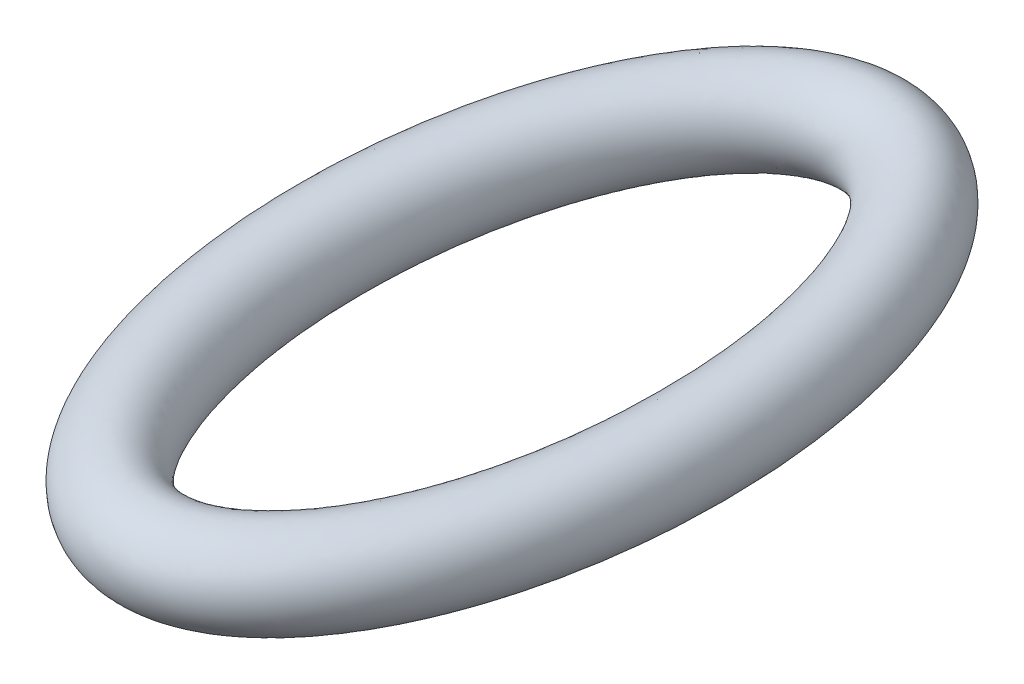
ISO-10303-21;
HEADER;
FILE_DESCRIPTION(('STEP AP214'),'2;1');
FILE_NAME('part.step','',(''),(''),'','','');
FILE_SCHEMA(('AUTOMOTIVE_DESIGN { 1 0 10303 214 1 1 1 1 }'));
ENDSEC;
DATA;
#1=APPLICATION_CONTEXT('core data for automotive mechanical design processes');
#2=APPLICATION_PROTOCOL_DEFINITION('international standard','automotive_design',2000,#1);
#3=PRODUCT_CONTEXT('',#1,'mechanical');
#4=PRODUCT('Part','Part','',(#3));
#5=PRODUCT_RELATED_PRODUCT_CATEGORY('part','',(#4));
#6=PRODUCT_DEFINITION_FORMATION('','',#4);
#7=PRODUCT_DEFINITION_CONTEXT('part definition',#1,'design');
#8=PRODUCT_DEFINITION('design','',#6,#7);
#9=PRODUCT_DEFINITION_SHAPE('','',#8);
#10=(LENGTH_UNIT() NAMED_UNIT(*) SI_UNIT(.MILLI.,.METRE.));
#11=(NAMED_UNIT(*) PLANE_ANGLE_UNIT() SI_UNIT($,.RADIAN.));
#12=(NAMED_UNIT(*) SI_UNIT($,.STERADIAN.) SOLID_ANGLE_UNIT());
#13=UNCERTAINTY_MEASURE_WITH_UNIT(LENGTH_MEASURE(1.E-05),#10,'distance_accuracy_value','');
#14=(GEOMETRIC_REPRESENTATION_CONTEXT(3) GLOBAL_UNCERTAINTY_ASSIGNED_CONTEXT((#13)) GLOBAL_UNIT_ASSIGNED_CONTEXT((#10,
#11,#12)) REPRESENTATION_CONTEXT('',''));
#15=CARTESIAN_POINT('',(0.,0.,0.));
#16=DIRECTION('',(0.,0.,1.));
#17=DIRECTION('',(1.,0.,0.));
#18=AXIS2_PLACEMENT_3D('',#15,#16,#17);
#19=CARTESIAN_POINT('',(50.,0.,0.));
#20=CARTESIAN_POINT('',(50.,0.,-6.01289865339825));
#21=CARTESIAN_POINT('',(49.3653925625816,0.,-17.6721832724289));
#22=CARTESIAN_POINT('',(46.8375894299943,0.,-33.5032940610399));
#23=CARTESIAN_POINT('',(43.1518349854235,0.,-47.1498640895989));
#24=CARTESIAN_POINT('',(38.7045890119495,0.,-58.47437408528));
#25=CARTESIAN_POINT('',(33.8151288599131,0.,-67.5938487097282));
#26=CARTESIAN_POINT('',(28.9431747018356,0.,-74.4244203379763));
#27=CARTESIAN_POINT('',(24.2594365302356,0.,-79.4884106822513));
#28=CARTESIAN_POINT('',(19.8460357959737,0.,-83.2015332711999));
#29=CARTESIAN_POINT('',(15.5042691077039,0.,-85.9789216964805));
#30=CARTESIAN_POINT('',(11.2896250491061,0.,-87.9420714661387));
#31=CARTESIAN_POINT('',(7.26191414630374,0.,-89.2035103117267));
#32=CARTESIAN_POINT('',(3.46411374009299,0.,-89.8739054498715));
#33=CARTESIAN_POINT('',(1.13057688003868,0.,-89.9999999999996));
#34=CARTESIAN_POINT('',(-1.13057688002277,0.,-90.0000000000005));
#35=CARTESIAN_POINT('',(-3.46411374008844,0.,-89.8739054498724));
#36=CARTESIAN_POINT('',(-7.26191414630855,0.,-89.2035103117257));
#37=CARTESIAN_POINT('',(-11.2896250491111,0.,-87.9420714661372));
#38=CARTESIAN_POINT('',(-15.504269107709,0.,-85.9789216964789));
#39=CARTESIAN_POINT('',(-19.8460357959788,0.,-83.201533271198));
#40=CARTESIAN_POINT('',(-24.2594365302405,0.,-79.4884106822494));
#41=CARTESIAN_POINT('',(-28.9431747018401,0.,-74.4244203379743));
#42=CARTESIAN_POINT('',(-33.815128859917,0.,-67.5938487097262));
#43=CARTESIAN_POINT('',(-38.7045890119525,0.,-58.4743740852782));
#44=CARTESIAN_POINT('',(-43.1518349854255,0.,-47.1498640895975));
#45=CARTESIAN_POINT('',(-46.8375894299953,0.,-33.5032940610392));
#46=CARTESIAN_POINT('',(-49.3653925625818,0.,-17.6721832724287));
#47=CARTESIAN_POINT('',(-50.,0.,-6.01289865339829));
#48=CARTESIAN_POINT('',(-50.,0.,6.01289865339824));
#49=CARTESIAN_POINT('',(-49.3653925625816,0.,17.6721832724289));
#50=CARTESIAN_POINT('',(-46.8375894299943,0.,33.50329406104));
#51=CARTESIAN_POINT('',(-43.1518349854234,0.,47.1498640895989));
#52=CARTESIAN_POINT('',(-38.7045890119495,0.,58.4743740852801));
#53=CARTESIAN_POINT('',(-33.815128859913,0.,67.5938487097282));
#54=CARTESIAN_POINT('',(-28.9431747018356,0.,74.4244203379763));
#55=CARTESIAN_POINT('',(-24.2594365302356,0.,79.4884106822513));
#56=CARTESIAN_POINT('',(-19.8460357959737,0.,83.2015332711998));
#57=CARTESIAN_POINT('',(-15.5042691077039,0.,85.9789216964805));
#58=CARTESIAN_POINT('',(-11.2896250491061,0.,87.9420714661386));
#59=CARTESIAN_POINT('',(-7.26191414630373,0.,89.2035103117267));
#60=CARTESIAN_POINT('',(-3.46411374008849,0.,89.8739054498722));
#61=CARTESIAN_POINT('',(-1.13057688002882,0.,90.0000000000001));
#62=CARTESIAN_POINT('',(1.13057688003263,0.,89.9999999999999));
#63=CARTESIAN_POINT('',(3.46411374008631,0.,89.8739054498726));
#64=CARTESIAN_POINT('',(7.26191414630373,0.,89.2035103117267));
#65=CARTESIAN_POINT('',(11.2896250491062,0.,87.9420714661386));
#66=CARTESIAN_POINT('',(15.5042691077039,0.,85.9789216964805));
#67=CARTESIAN_POINT('',(19.8460357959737,0.,83.2015332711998));
#68=CARTESIAN_POINT('',(24.2594365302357,0.,79.4884106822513));
#69=CARTESIAN_POINT('',(28.9431747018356,0.,74.4244203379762));
#70=CARTESIAN_POINT('',(33.8151288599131,0.,67.5938487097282));
#71=CARTESIAN_POINT('',(38.7045890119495,0.,58.47437408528));
#72=CARTESIAN_POINT('',(43.1518349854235,0.,47.1498640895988));
#73=CARTESIAN_POINT('',(46.8375894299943,0.,33.5032940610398));
#74=CARTESIAN_POINT('',(49.3653925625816,0.,17.6721832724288));
#75=CARTESIAN_POINT('',(50.,0.,6.01289865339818));
#76=CARTESIAN_POINT('',(50.,0.,0.));
#77=CARTESIAN_POINT('',(50.,20.,0.));
#78=CARTESIAN_POINT('',(50.,20.,-6.01289865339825));
#79=CARTESIAN_POINT('',(49.3653925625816,20.,-17.6721832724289));
#80=CARTESIAN_POINT('',(46.8375894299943,20.,-33.5032940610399));
#81=CARTESIAN_POINT('',(43.1518349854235,20.,-47.1498640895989));
#82=CARTESIAN_POINT('',(38.7045890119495,20.,-58.47437408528));
#83=CARTESIAN_POINT('',(33.8151288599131,20.,-67.5938487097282));
#84=CARTESIAN_POINT('',(28.9431747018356,20.,-74.4244203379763));
#85=CARTESIAN_POINT('',(24.2594365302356,20.,-79.4884106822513));
#86=CARTESIAN_POINT('',(19.8460357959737,20.,-83.2015332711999));
#87=CARTESIAN_POINT('',(15.5042691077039,20.,-85.9789216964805));
#88=CARTESIAN_POINT('',(11.2896250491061,20.,-87.9420714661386));
#89=CARTESIAN_POINT('',(7.26191414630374,20.,-89.2035103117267));
#90=CARTESIAN_POINT('',(3.464113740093,20.,-89.8739054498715));
#91=CARTESIAN_POINT('',(1.13057688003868,20.,-89.9999999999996));
#92=CARTESIAN_POINT('',(-1.13057688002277,20.,-90.0000000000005));
#93=CARTESIAN_POINT('',(-3.46411374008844,20.,-89.8739054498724));
#94=CARTESIAN_POINT('',(-7.26191414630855,20.,-89.2035103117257));
#95=CARTESIAN_POINT('',(-11.2896250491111,20.,-87.9420714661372));
#96=CARTESIAN_POINT('',(-15.504269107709,20.,-85.9789216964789));
#97=CARTESIAN_POINT('',(-19.8460357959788,20.,-83.201533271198));
#98=CARTESIAN_POINT('',(-24.2594365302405,20.,-79.4884106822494));
#99=CARTESIAN_POINT('',(-28.9431747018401,20.,-74.4244203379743));
#100=CARTESIAN_POINT('',(-33.815128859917,20.,-67.5938487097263));
#101=CARTESIAN_POINT('',(-38.7045890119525,20.,-58.4743740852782));
#102=CARTESIAN_POINT('',(-43.1518349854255,20.,-47.1498640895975));
#103=CARTESIAN_POINT('',(-46.8375894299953,20.,-33.5032940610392));
#104=CARTESIAN_POINT('',(-49.3653925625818,20.,-17.6721832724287));
#105=CARTESIAN_POINT('',(-50.,20.,-6.01289865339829));
#106=CARTESIAN_POINT('',(-50.,20.,6.01289865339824));
#107=CARTESIAN_POINT('',(-49.3653925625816,20.,17.6721832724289));
#108=CARTESIAN_POINT('',(-46.8375894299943,20.,33.50329406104));
#109=CARTESIAN_POINT('',(-43.1518349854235,20.,47.1498640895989));
#110=CARTESIAN_POINT('',(-38.7045890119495,20.,58.4743740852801));
#111=CARTESIAN_POINT('',(-33.815128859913,20.,67.5938487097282));
#112=CARTESIAN_POINT('',(-28.9431747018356,20.,74.4244203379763));
#113=CARTESIAN_POINT('',(-24.2594365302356,20.,79.4884106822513));
#114=CARTESIAN_POINT('',(-19.8460357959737,20.,83.2015332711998));
#115=CARTESIAN_POINT('',(-15.5042691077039,20.,85.9789216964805));
#116=CARTESIAN_POINT('',(-11.2896250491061,20.,87.9420714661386));
#117=CARTESIAN_POINT('',(-7.26191414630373,20.,89.2035103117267));
#118=CARTESIAN_POINT('',(-3.46411374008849,20.,89.8739054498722));
#119=CARTESIAN_POINT('',(-1.13057688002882,20.,90.0000000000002));
#120=CARTESIAN_POINT('',(1.13057688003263,20.,89.9999999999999));
#121=CARTESIAN_POINT('',(3.46411374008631,20.,89.8739054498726));
#122=CARTESIAN_POINT('',(7.26191414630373,20.,89.2035103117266));
#123=CARTESIAN_POINT('',(11.2896250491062,20.,87.9420714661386));
#124=CARTESIAN_POINT('',(15.5042691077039,20.,85.9789216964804));
#125=CARTESIAN_POINT('',(19.8460357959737,20.,83.2015332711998));
#126=CARTESIAN_POINT('',(24.2594365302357,20.,79.4884106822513));
#127=CARTESIAN_POINT('',(28.9431747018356,20.,74.4244203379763));
#128=CARTESIAN_POINT('',(33.8151288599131,20.,67.5938487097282));
#129=CARTESIAN_POINT('',(38.7045890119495,20.,58.47437408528));
#130=CARTESIAN_POINT('',(43.1518349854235,20.,47.1498640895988));
#131=CARTESIAN_POINT('',(46.8375894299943,20.,33.5032940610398));
#132=CARTESIAN_POINT('',(49.3653925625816,20.,17.6721832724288));
#133=CARTESIAN_POINT('',(50.,20.,6.01289865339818));
#134=CARTESIAN_POINT('',(50.,20.,0.));
#135=CARTESIAN_POINT('',(30.,20.,0.));
#136=CARTESIAN_POINT('',(30.,20.,-5.3141403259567));
#137=CARTESIAN_POINT('',(29.4395134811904,20.,-15.5759082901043));
#138=CARTESIAN_POINT('',(27.2336156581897,20.,-29.3632891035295));
#139=CARTESIAN_POINT('',(24.098703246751,20.,-40.9377840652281));
#140=CARTESIAN_POINT('',(20.4713989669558,20.,-50.1442313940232));
#141=CARTESIAN_POINT('',(16.7262725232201,20.,-57.0995138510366));
#142=CARTESIAN_POINT('',(13.3093268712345,20.,-61.8635213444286));
#143=CARTESIAN_POINT('',(10.3640922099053,20.,-65.0311658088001));
#144=CARTESIAN_POINT('',(7.90822260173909,20.,-67.0841707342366));
#145=CARTESIAN_POINT('',(5.7959192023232,20.,-68.425196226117));
#146=CARTESIAN_POINT('',(4.004408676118,20.,-69.2531426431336));
#147=CARTESIAN_POINT('',(2.47916126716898,20.,-69.7263179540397));
#148=CARTESIAN_POINT('',(1.16493567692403,20.,-69.9579759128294));
#149=CARTESIAN_POINT('',(0.364184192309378,20.,-70.0000000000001));
#150=CARTESIAN_POINT('',(-0.364184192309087,20.,-70.));
#151=CARTESIAN_POINT('',(-1.16493567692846,20.,-69.9579759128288));
#152=CARTESIAN_POINT('',(-2.47916126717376,20.,-69.7263179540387));
#153=CARTESIAN_POINT('',(-4.00440867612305,20.,-69.2531426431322));
#154=CARTESIAN_POINT('',(-5.79591920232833,20.,-68.4251962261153));
#155=CARTESIAN_POINT('',(-7.90822260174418,20.,-67.0841707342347));
#156=CARTESIAN_POINT('',(-10.3640922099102,20.,-65.0311658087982));
#157=CARTESIAN_POINT('',(-13.309326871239,20.,-61.8635213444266));
#158=CARTESIAN_POINT('',(-16.726272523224,20.,-57.0995138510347));
#159=CARTESIAN_POINT('',(-20.4713989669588,20.,-50.1442313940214));
#160=CARTESIAN_POINT('',(-24.098703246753,20.,-40.9377840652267));
#161=CARTESIAN_POINT('',(-27.2336156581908,20.,-29.3632891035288));
#162=CARTESIAN_POINT('',(-29.4395134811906,20.,-15.5759082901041));
#163=CARTESIAN_POINT('',(-30.,20.,-5.31414032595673));
#164=CARTESIAN_POINT('',(-30.,20.,5.31414032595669));
#165=CARTESIAN_POINT('',(-29.4395134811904,20.,15.5759082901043));
#166=CARTESIAN_POINT('',(-27.2336156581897,20.,29.3632891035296));
#167=CARTESIAN_POINT('',(-24.098703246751,20.,40.9377840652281));
#168=CARTESIAN_POINT('',(-20.4713989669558,20.,50.1442313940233));
#169=CARTESIAN_POINT('',(-16.72627252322,20.,57.0995138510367));
#170=CARTESIAN_POINT('',(-13.3093268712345,20.,61.8635213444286));
#171=CARTESIAN_POINT('',(-10.3640922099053,20.,65.0311658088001));
#172=CARTESIAN_POINT('',(-7.90822260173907,20.,67.0841707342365));
#173=CARTESIAN_POINT('',(-5.79591920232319,20.,68.425196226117));
#174=CARTESIAN_POINT('',(-4.00440867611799,20.,69.2531426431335));
#175=CARTESIAN_POINT('',(-2.47916126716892,20.,69.7263179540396));
#176=CARTESIAN_POINT('',(-1.16493567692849,20.,69.9579759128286));
#177=CARTESIAN_POINT('',(-0.364184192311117,20.,69.9999999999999));
#178=CARTESIAN_POINT('',(0.36418419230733,20.,70.0000000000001));
#179=CARTESIAN_POINT('',(1.1649356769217,20.,69.9579759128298));
#180=CARTESIAN_POINT('',(2.47916126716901,20.,69.7263179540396));
#181=CARTESIAN_POINT('',(4.004408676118,20.,69.2531426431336));
#182=CARTESIAN_POINT('',(5.79591920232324,20.,68.4251962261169));
#183=CARTESIAN_POINT('',(7.90822260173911,20.,67.0841707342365));
#184=CARTESIAN_POINT('',(10.3640922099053,20.,65.0311658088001));
#185=CARTESIAN_POINT('',(13.3093268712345,20.,61.8635213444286));
#186=CARTESIAN_POINT('',(16.7262725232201,20.,57.0995138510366));
#187=CARTESIAN_POINT('',(20.4713989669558,20.,50.1442313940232));
#188=CARTESIAN_POINT('',(24.098703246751,20.,40.937784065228));
#189=CARTESIAN_POINT('',(27.2336156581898,20.,29.3632891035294));
#190=CARTESIAN_POINT('',(29.4395134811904,20.,15.5759082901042));
#191=CARTESIAN_POINT('',(30.,20.,5.31414032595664));
#192=CARTESIAN_POINT('',(30.,20.,0.));
#193=CARTESIAN_POINT('',(30.,0.,0.));
#194=CARTESIAN_POINT('',(30.,0.,-5.3141403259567));
#195=CARTESIAN_POINT('',(29.4395134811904,0.,-15.5759082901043));
#196=CARTESIAN_POINT('',(27.2336156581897,0.,-29.3632891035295));
#197=CARTESIAN_POINT('',(24.098703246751,0.,-40.9377840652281));
#198=CARTESIAN_POINT('',(20.4713989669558,0.,-50.1442313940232));
#199=CARTESIAN_POINT('',(16.7262725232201,0.,-57.0995138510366));
#200=CARTESIAN_POINT('',(13.3093268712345,0.,-61.8635213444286));
#201=CARTESIAN_POINT('',(10.3640922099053,0.,-65.0311658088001));
#202=CARTESIAN_POINT('',(7.90822260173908,0.,-67.0841707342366));
#203=CARTESIAN_POINT('',(5.7959192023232,0.,-68.425196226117));
#204=CARTESIAN_POINT('',(4.004408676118,0.,-69.2531426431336));
#205=CARTESIAN_POINT('',(2.47916126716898,0.,-69.7263179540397));
#206=CARTESIAN_POINT('',(1.16493567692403,0.,-69.9579759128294));
#207=CARTESIAN_POINT('',(0.364184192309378,0.,-70.0000000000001));
#208=CARTESIAN_POINT('',(-0.364184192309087,0.,-70.));
#209=CARTESIAN_POINT('',(-1.16493567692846,0.,-69.9579759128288));
#210=CARTESIAN_POINT('',(-2.47916126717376,0.,-69.7263179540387));
#211=CARTESIAN_POINT('',(-4.00440867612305,0.,-69.2531426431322));
#212=CARTESIAN_POINT('',(-5.79591920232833,0.,-68.4251962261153));
#213=CARTESIAN_POINT('',(-7.90822260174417,0.,-67.0841707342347));
#214=CARTESIAN_POINT('',(-10.3640922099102,0.,-65.0311658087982));
#215=CARTESIAN_POINT('',(-13.309326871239,0.,-61.8635213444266));
#216=CARTESIAN_POINT('',(-16.726272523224,0.,-57.0995138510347));
#217=CARTESIAN_POINT('',(-20.4713989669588,0.,-50.1442313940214));
#218=CARTESIAN_POINT('',(-24.098703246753,0.,-40.9377840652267));
#219=CARTESIAN_POINT('',(-27.2336156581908,0.,-29.3632891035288));
#220=CARTESIAN_POINT('',(-29.4395134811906,0.,-15.5759082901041));
#221=CARTESIAN_POINT('',(-30.,0.,-5.31414032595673));
#222=CARTESIAN_POINT('',(-30.,0.,5.3141403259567));
#223=CARTESIAN_POINT('',(-29.4395134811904,0.,15.5759082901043));
#224=CARTESIAN_POINT('',(-27.2336156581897,0.,29.3632891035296));
#225=CARTESIAN_POINT('',(-24.098703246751,0.,40.9377840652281));
#226=CARTESIAN_POINT('',(-20.4713989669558,0.,50.1442313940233));
#227=CARTESIAN_POINT('',(-16.72627252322,0.,57.0995138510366));
#228=CARTESIAN_POINT('',(-13.3093268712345,0.,61.8635213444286));
#229=CARTESIAN_POINT('',(-10.3640922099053,0.,65.0311658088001));
#230=CARTESIAN_POINT('',(-7.90822260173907,0.,67.0841707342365));
#231=CARTESIAN_POINT('',(-5.79591920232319,0.,68.425196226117));
#232=CARTESIAN_POINT('',(-4.00440867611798,0.,69.2531426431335));
#233=CARTESIAN_POINT('',(-2.47916126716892,0.,69.7263179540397));
#234=CARTESIAN_POINT('',(-1.16493567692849,0.,69.9579759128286));
#235=CARTESIAN_POINT('',(-0.364184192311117,0.,69.9999999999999));
#236=CARTESIAN_POINT('',(0.36418419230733,0.,70.0000000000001));
#237=CARTESIAN_POINT('',(1.1649356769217,0.,69.9579759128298));
#238=CARTESIAN_POINT('',(2.47916126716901,0.,69.7263179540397));
#239=CARTESIAN_POINT('',(4.004408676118,0.,69.2531426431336));
#240=CARTESIAN_POINT('',(5.79591920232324,0.,68.4251962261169));
#241=CARTESIAN_POINT('',(7.90822260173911,0.,67.0841707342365));
#242=CARTESIAN_POINT('',(10.3640922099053,0.,65.0311658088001));
#243=CARTESIAN_POINT('',(13.3093268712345,0.,61.8635213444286));
#244=CARTESIAN_POINT('',(16.7262725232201,0.,57.0995138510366));
#245=CARTESIAN_POINT('',(20.4713989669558,0.,50.1442313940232));
#246=CARTESIAN_POINT('',(24.098703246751,0.,40.937784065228));
#247=CARTESIAN_POINT('',(27.2336156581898,0.,29.3632891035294));
#248=CARTESIAN_POINT('',(29.4395134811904,0.,15.5759082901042));
#249=CARTESIAN_POINT('',(30.,0.,5.31414032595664));
#250=CARTESIAN_POINT('',(30.,0.,0.));
#251=CARTESIAN_POINT('',(30.,-20.,0.));
#252=CARTESIAN_POINT('',(30.,-20.,-5.3141403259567));
#253=CARTESIAN_POINT('',(29.4395134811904,-20.,-15.5759082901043));
#254=CARTESIAN_POINT('',(27.2336156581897,-20.,-29.3632891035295));
#255=CARTESIAN_POINT('',(24.098703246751,-20.,-40.9377840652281));
#256=CARTESIAN_POINT('',(20.4713989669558,-20.,-50.1442313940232));
#257=CARTESIAN_POINT('',(16.7262725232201,-20.,-57.0995138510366));
#258=CARTESIAN_POINT('',(13.3093268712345,-20.,-61.8635213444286));
#259=CARTESIAN_POINT('',(10.3640922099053,-20.,-65.0311658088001));
#260=CARTESIAN_POINT('',(7.90822260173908,-20.,-67.0841707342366));
#261=CARTESIAN_POINT('',(5.7959192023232,-20.,-68.425196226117));
#262=CARTESIAN_POINT('',(4.004408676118,-20.,-69.2531426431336));
#263=CARTESIAN_POINT('',(2.47916126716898,-20.,-69.7263179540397));
#264=CARTESIAN_POINT('',(1.16493567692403,-20.,-69.9579759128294));
#265=CARTESIAN_POINT('',(0.364184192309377,-20.,-70.0000000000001));
#266=CARTESIAN_POINT('',(-0.364184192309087,-20.,-70.));
#267=CARTESIAN_POINT('',(-1.16493567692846,-20.,-69.9579759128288));
#268=CARTESIAN_POINT('',(-2.47916126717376,-20.,-69.7263179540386));
#269=CARTESIAN_POINT('',(-4.00440867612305,-20.,-69.2531426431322));
#270=CARTESIAN_POINT('',(-5.79591920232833,-20.,-68.4251962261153));
#271=CARTESIAN_POINT('',(-7.90822260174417,-20.,-67.0841707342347));
#272=CARTESIAN_POINT('',(-10.3640922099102,-20.,-65.0311658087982));
#273=CARTESIAN_POINT('',(-13.309326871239,-20.,-61.8635213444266));
#274=CARTESIAN_POINT('',(-16.726272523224,-20.,-57.0995138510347));
#275=CARTESIAN_POINT('',(-20.4713989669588,-20.,-50.1442313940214));
#276=CARTESIAN_POINT('',(-24.098703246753,-20.,-40.9377840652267));
#277=CARTESIAN_POINT('',(-27.2336156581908,-20.,-29.3632891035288));
#278=CARTESIAN_POINT('',(-29.4395134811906,-20.,-15.5759082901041));
#279=CARTESIAN_POINT('',(-30.,-20.,-5.31414032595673));
#280=CARTESIAN_POINT('',(-30.,-20.,5.31414032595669));
#281=CARTESIAN_POINT('',(-29.4395134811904,-20.,15.5759082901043));
#282=CARTESIAN_POINT('',(-27.2336156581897,-20.,29.3632891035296));
#283=CARTESIAN_POINT('',(-24.098703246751,-20.,40.9377840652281));
#284=CARTESIAN_POINT('',(-20.4713989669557,-20.,50.1442313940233));
#285=CARTESIAN_POINT('',(-16.72627252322,-20.,57.0995138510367));
#286=CARTESIAN_POINT('',(-13.3093268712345,-20.,61.8635213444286));
#287=CARTESIAN_POINT('',(-10.3640922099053,-20.,65.0311658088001));
#288=CARTESIAN_POINT('',(-7.90822260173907,-20.,67.0841707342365));
#289=CARTESIAN_POINT('',(-5.79591920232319,-20.,68.425196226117));
#290=CARTESIAN_POINT('',(-4.00440867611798,-20.,69.2531426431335));
#291=CARTESIAN_POINT('',(-2.47916126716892,-20.,69.7263179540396));
#292=CARTESIAN_POINT('',(-1.16493567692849,-20.,69.9579759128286));
#293=CARTESIAN_POINT('',(-0.364184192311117,-20.,69.9999999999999));
#294=CARTESIAN_POINT('',(0.36418419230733,-20.,70.0000000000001));
#295=CARTESIAN_POINT('',(1.1649356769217,-20.,69.9579759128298));
#296=CARTESIAN_POINT('',(2.47916126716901,-20.,69.7263179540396));
#297=CARTESIAN_POINT('',(4.004408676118,-20.,69.2531426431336));
#298=CARTESIAN_POINT('',(5.79591920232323,-20.,68.4251962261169));
#299=CARTESIAN_POINT('',(7.9082226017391,-20.,67.0841707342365));
#300=CARTESIAN_POINT('',(10.3640922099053,-20.,65.0311658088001));
#301=CARTESIAN_POINT('',(13.3093268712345,-20.,61.8635213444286));
#302=CARTESIAN_POINT('',(16.7262725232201,-20.,57.0995138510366));
#303=CARTESIAN_POINT('',(20.4713989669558,-20.,50.1442313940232));
#304=CARTESIAN_POINT('',(24.098703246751,-20.,40.937784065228));
#305=CARTESIAN_POINT('',(27.2336156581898,-20.,29.3632891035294));
#306=CARTESIAN_POINT('',(29.4395134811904,-20.,15.5759082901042));
#307=CARTESIAN_POINT('',(30.,-20.,5.31414032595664));
#308=CARTESIAN_POINT('',(30.,-20.,0.));
#309=CARTESIAN_POINT('',(50.,-20.,0.));
#310=CARTESIAN_POINT('',(50.,-20.,-6.01289865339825));
#311=CARTESIAN_POINT('',(49.3653925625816,-20.,-17.6721832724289));
#312=CARTESIAN_POINT('',(46.8375894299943,-20.,-33.5032940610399));
#313=CARTESIAN_POINT('',(43.1518349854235,-20.,-47.1498640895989));
#314=CARTESIAN_POINT('',(38.7045890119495,-20.,-58.47437408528));
#315=CARTESIAN_POINT('',(33.8151288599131,-20.,-67.5938487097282));
#316=CARTESIAN_POINT('',(28.9431747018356,-20.,-74.4244203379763));
#317=CARTESIAN_POINT('',(24.2594365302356,-20.,-79.4884106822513));
#318=CARTESIAN_POINT('',(19.8460357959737,-20.,-83.2015332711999));
#319=CARTESIAN_POINT('',(15.5042691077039,-20.,-85.9789216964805));
#320=CARTESIAN_POINT('',(11.2896250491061,-20.,-87.9420714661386));
#321=CARTESIAN_POINT('',(7.26191414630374,-20.,-89.2035103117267));
#322=CARTESIAN_POINT('',(3.464113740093,-20.,-89.8739054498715));
#323=CARTESIAN_POINT('',(1.13057688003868,-20.,-89.9999999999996));
#324=CARTESIAN_POINT('',(-1.13057688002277,-20.,-90.0000000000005));
#325=CARTESIAN_POINT('',(-3.46411374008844,-20.,-89.8739054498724));
#326=CARTESIAN_POINT('',(-7.26191414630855,-20.,-89.2035103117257));
#327=CARTESIAN_POINT('',(-11.2896250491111,-20.,-87.9420714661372));
#328=CARTESIAN_POINT('',(-15.504269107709,-20.,-85.9789216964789));
#329=CARTESIAN_POINT('',(-19.8460357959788,-20.,-83.201533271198));
#330=CARTESIAN_POINT('',(-24.2594365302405,-20.,-79.4884106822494));
#331=CARTESIAN_POINT('',(-28.9431747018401,-20.,-74.4244203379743));
#332=CARTESIAN_POINT('',(-33.815128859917,-20.,-67.5938487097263));
#333=CARTESIAN_POINT('',(-38.7045890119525,-20.,-58.4743740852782));
#334=CARTESIAN_POINT('',(-43.1518349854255,-20.,-47.1498640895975));
#335=CARTESIAN_POINT('',(-46.8375894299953,-20.,-33.5032940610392));
#336=CARTESIAN_POINT('',(-49.3653925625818,-20.,-17.6721832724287));
#337=CARTESIAN_POINT('',(-50.,-20.,-6.01289865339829));
#338=CARTESIAN_POINT('',(-50.,-20.,6.01289865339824));
#339=CARTESIAN_POINT('',(-49.3653925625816,-20.,17.6721832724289));
#340=CARTESIAN_POINT('',(-46.8375894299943,-20.,33.50329406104));
#341=CARTESIAN_POINT('',(-43.1518349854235,-20.,47.1498640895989));
#342=CARTESIAN_POINT('',(-38.7045890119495,-20.,58.4743740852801));
#343=CARTESIAN_POINT('',(-33.815128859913,-20.,67.5938487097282));
#344=CARTESIAN_POINT('',(-28.9431747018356,-20.,74.4244203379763));
#345=CARTESIAN_POINT('',(-24.2594365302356,-20.,79.4884106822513));
#346=CARTESIAN_POINT('',(-19.8460357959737,-20.,83.2015332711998));
#347=CARTESIAN_POINT('',(-15.5042691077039,-20.,85.9789216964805));
#348=CARTESIAN_POINT('',(-11.2896250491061,-20.,87.9420714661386));
#349=CARTESIAN_POINT('',(-7.26191414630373,-20.,89.2035103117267));
#350=CARTESIAN_POINT('',(-3.46411374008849,-20.,89.8739054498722));
#351=CARTESIAN_POINT('',(-1.13057688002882,-20.,90.0000000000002));
#352=CARTESIAN_POINT('',(1.13057688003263,-20.,89.9999999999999));
#353=CARTESIAN_POINT('',(3.46411374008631,-20.,89.8739054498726));
#354=CARTESIAN_POINT('',(7.26191414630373,-20.,89.2035103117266));
#355=CARTESIAN_POINT('',(11.2896250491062,-20.,87.9420714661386));
#356=CARTESIAN_POINT('',(15.5042691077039,-20.,85.9789216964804));
#357=CARTESIAN_POINT('',(19.8460357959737,-20.,83.2015332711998));
#358=CARTESIAN_POINT('',(24.2594365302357,-20.,79.4884106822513));
#359=CARTESIAN_POINT('',(28.9431747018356,-20.,74.4244203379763));
#360=CARTESIAN_POINT('',(33.8151288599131,-20.,67.5938487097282));
#361=CARTESIAN_POINT('',(38.7045890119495,-20.,58.47437408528));
#362=CARTESIAN_POINT('',(43.1518349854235,-20.,47.1498640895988));
#363=CARTESIAN_POINT('',(46.8375894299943,-20.,33.5032940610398));
#364=CARTESIAN_POINT('',(49.3653925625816,-20.,17.6721832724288));
#365=CARTESIAN_POINT('',(50.,-20.,6.01289865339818));
#366=CARTESIAN_POINT('',(50.,-20.,0.));
#367=CARTESIAN_POINT('',(50.,0.,0.));
#368=CARTESIAN_POINT('',(50.,0.,-6.01289865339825));
#369=CARTESIAN_POINT('',(49.3653925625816,0.,-17.6721832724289));
#370=CARTESIAN_POINT('',(46.8375894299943,0.,-33.5032940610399));
#371=CARTESIAN_POINT('',(43.1518349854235,0.,-47.1498640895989));
#372=CARTESIAN_POINT('',(38.7045890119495,0.,-58.47437408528));
#373=CARTESIAN_POINT('',(33.8151288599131,0.,-67.5938487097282));
#374=CARTESIAN_POINT('',(28.9431747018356,0.,-74.4244203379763));
#375=CARTESIAN_POINT('',(24.2594365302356,0.,-79.4884106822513));
#376=CARTESIAN_POINT('',(19.8460357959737,0.,-83.2015332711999));
#377=CARTESIAN_POINT('',(15.5042691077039,0.,-85.9789216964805));
#378=CARTESIAN_POINT('',(11.2896250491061,0.,-87.9420714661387));
#379=CARTESIAN_POINT('',(7.26191414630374,0.,-89.2035103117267));
#380=CARTESIAN_POINT('',(3.46411374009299,0.,-89.8739054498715));
#381=CARTESIAN_POINT('',(1.13057688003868,0.,-89.9999999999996));
#382=CARTESIAN_POINT('',(-1.13057688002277,0.,-90.0000000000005));
#383=CARTESIAN_POINT('',(-3.46411374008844,0.,-89.8739054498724));
#384=CARTESIAN_POINT('',(-7.26191414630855,0.,-89.2035103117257));
#385=CARTESIAN_POINT('',(-11.2896250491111,0.,-87.9420714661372));
#386=CARTESIAN_POINT('',(-15.504269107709,0.,-85.9789216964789));
#387=CARTESIAN_POINT('',(-19.8460357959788,0.,-83.201533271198));
#388=CARTESIAN_POINT('',(-24.2594365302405,0.,-79.4884106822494));
#389=CARTESIAN_POINT('',(-28.9431747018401,0.,-74.4244203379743));
#390=CARTESIAN_POINT('',(-33.815128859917,0.,-67.5938487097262));
#391=CARTESIAN_POINT('',(-38.7045890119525,0.,-58.4743740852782));
#392=CARTESIAN_POINT('',(-43.1518349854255,0.,-47.1498640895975));
#393=CARTESIAN_POINT('',(-46.8375894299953,0.,-33.5032940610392));
#394=CARTESIAN_POINT('',(-49.3653925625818,0.,-17.6721832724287));
#395=CARTESIAN_POINT('',(-50.,0.,-6.01289865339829));
#396=CARTESIAN_POINT('',(-50.,0.,6.01289865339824));
#397=CARTESIAN_POINT('',(-49.3653925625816,0.,17.6721832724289));
#398=CARTESIAN_POINT('',(-46.8375894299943,0.,33.50329406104));
#399=CARTESIAN_POINT('',(-43.1518349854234,0.,47.1498640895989));
#400=CARTESIAN_POINT('',(-38.7045890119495,0.,58.4743740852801));
#401=CARTESIAN_POINT('',(-33.815128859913,0.,67.5938487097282));
#402=CARTESIAN_POINT('',(-28.9431747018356,0.,74.4244203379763));
#403=CARTESIAN_POINT('',(-24.2594365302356,0.,79.4884106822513));
#404=CARTESIAN_POINT('',(-19.8460357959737,0.,83.2015332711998));
#405=CARTESIAN_POINT('',(-15.5042691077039,0.,85.9789216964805));
#406=CARTESIAN_POINT('',(-11.2896250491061,0.,87.9420714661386));
#407=CARTESIAN_POINT('',(-7.26191414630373,0.,89.2035103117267));
#408=CARTESIAN_POINT('',(-3.46411374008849,0.,89.8739054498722));
#409=CARTESIAN_POINT('',(-1.13057688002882,0.,90.0000000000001));
#410=CARTESIAN_POINT('',(1.13057688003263,0.,89.9999999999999));
#411=CARTESIAN_POINT('',(3.46411374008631,0.,89.8739054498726));
#412=CARTESIAN_POINT('',(7.26191414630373,0.,89.2035103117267));
#413=CARTESIAN_POINT('',(11.2896250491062,0.,87.9420714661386));
#414=CARTESIAN_POINT('',(15.5042691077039,0.,85.9789216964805));
#415=CARTESIAN_POINT('',(19.8460357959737,0.,83.2015332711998));
#416=CARTESIAN_POINT('',(24.2594365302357,0.,79.4884106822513));
#417=CARTESIAN_POINT('',(28.9431747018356,0.,74.4244203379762));
#418=CARTESIAN_POINT('',(33.8151288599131,0.,67.5938487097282));
#419=CARTESIAN_POINT('',(38.7045890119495,0.,58.47437408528));
#420=CARTESIAN_POINT('',(43.1518349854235,0.,47.1498640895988));
#421=CARTESIAN_POINT('',(46.8375894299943,0.,33.5032940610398));
#422=CARTESIAN_POINT('',(49.3653925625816,0.,17.6721832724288));
#423=CARTESIAN_POINT('',(50.,0.,6.01289865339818));
#424=CARTESIAN_POINT('',(50.,0.,0.));
#425=(BOUNDED_SURFACE() B_SPLINE_SURFACE(3,3,((#19,#20,#21,#22,#23,#24,#25,#26,#27,#28,#29,#30,
#31,#32,#33,#34,#35,#36,#37,#38,#39,#40,#41,#42,#43,#44,#45,#46,#47,#48,#49,#50,#51,#52,#53,#54,
#55,#56,#57,#58,#59,#60,#61,#62,#63,#64,#65,#66,#67,#68,#69,#70,#71,#72,#73,#74,#75,#76),(#77,
#78,#79,#80,#81,#82,#83,#84,#85,#86,#87,#88,#89,#90,#91,#92,#93,#94,#95,#96,#97,#98,#99,#100,
#101,#102,#103,#104,#105,#106,#107,#108,#109,#110,#111,#112,#113,#114,#115,#116,#117,#118,#119,
#120,#121,#122,#123,#124,#125,#126,#127,#128,#129,#130,#131,#132,#133,#134),(#135,#136,#137,
#138,#139,#140,#141,#142,#143,#144,#145,#146,#147,#148,#149,#150,#151,#152,#153,#154,#155,#156,
#157,#158,#159,#160,#161,#162,#163,#164,#165,#166,#167,#168,#169,#170,#171,#172,#173,#174,#175,
#176,#177,#178,#179,#180,#181,#182,#183,#184,#185,#186,#187,#188,#189,#190,#191,#192),(#193,
#194,#195,#196,#197,#198,#199,#200,#201,#202,#203,#204,#205,#206,#207,#208,#209,#210,#211,#212,
#213,#214,#215,#216,#217,#218,#219,#220,#221,#222,#223,#224,#225,#226,#227,#228,#229,#230,#231,
#232,#233,#234,#235,#236,#237,#238,#239,#240,#241,#242,#243,#244,#245,#246,#247,#248,#249,#250),
(#251,#252,#253,#254,#255,#256,#257,#258,#259,#260,#261,#262,#263,#264,#265,#266,#267,#268,#269,
#270,#271,#272,#273,#274,#275,#276,#277,#278,#279,#280,#281,#282,#283,#284,#285,#286,#287,#288,
#289,#290,#291,#292,#293,#294,#295,#296,#297,#298,#299,#300,#301,#302,#303,#304,#305,#306,#307,
#308),(#309,#310,#311,#312,#313,#314,#315,#316,#317,#318,#319,#320,#321,#322,#323,#324,#325,
#326,#327,#328,#329,#330,#331,#332,#333,#334,#335,#336,#337,#338,#339,#340,#341,#342,#343,#344,
#345,#346,#347,#348,#349,#350,#351,#352,#353,#354,#355,#356,#357,#358,#359,#360,#361,#362,#363,
#364,#365,#366),(#367,#368,#369,#370,#371,#372,#373,#374,#375,#376,#377,#378,#379,#380,#381,
#382,#383,#384,#385,#386,#387,#388,#389,#390,#391,#392,#393,#394,#395,#396,#397,#398,#399,#400,
#401,#402,#403,#404,#405,#406,#407,#408,#409,#410,#411,#412,#413,#414,#415,#416,#417,#418,#419,
#420,#421,#422,#423,#424)),.UNSPECIFIED.,.T.,.T.,.F.) B_SPLINE_SURFACE_WITH_KNOTS((4,3,4),(4,1,
1,1,1,1,1,1,1,1,1,1,1,2,1,1,1,1,1,1,1,1,1,1,1,1,2,1,1,1,1,1,1,1,1,1,1,1,1,2,1,1,1,1,1,1,1,1,1,1,
1,1,4),(0.,0.5,1.),(0.,0.0208333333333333,0.0416666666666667,0.0625,0.0833333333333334,
0.104166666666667,0.125,0.142857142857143,0.160714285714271,0.178571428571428,0.196428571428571,
0.214285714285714,0.232142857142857,0.249999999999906,0.267857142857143,0.285714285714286,
0.303571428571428,0.321428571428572,0.339285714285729,0.357142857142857,0.375,0.395833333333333,
0.416666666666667,0.4375,0.458333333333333,0.479166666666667,0.5,0.520833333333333,
0.541666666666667,0.5625,0.583333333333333,0.604166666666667,0.625,0.642857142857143,
0.660714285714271,0.678571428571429,0.696428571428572,0.714285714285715,0.732142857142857,
0.750000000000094,0.767857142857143,0.785714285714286,0.803571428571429,0.821428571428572,
0.83928571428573,0.857142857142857,0.875,0.895833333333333,0.916666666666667,0.9375,
0.958333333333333,0.979166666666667,1.),
.UNSPECIFIED.) GEOMETRIC_REPRESENTATION_ITEM() RATIONAL_B_SPLINE_SURFACE(((1.,1.,1.,1.,1.,1.,1.,
1.,1.,1.,1.,1.,1.,1.,1.,1.,1.,1.,1.,1.,1.,1.,1.,1.,1.,1.,1.,1.,1.,1.,1.,1.,1.,1.,1.,1.,1.,1.,1.,
1.,1.,1.,1.,1.,1.,1.,1.,1.,1.,1.,1.,1.,1.,1.,1.,1.,1.,1.),(0.333333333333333,0.333333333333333,
0.333333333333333,0.333333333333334,0.333333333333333,0.333333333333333,0.333333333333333,
0.333333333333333,0.333333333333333,0.333333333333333,0.333333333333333,0.333333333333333,
0.333333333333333,0.333333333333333,0.333333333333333,0.333333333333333,0.333333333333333,
0.333333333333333,0.333333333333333,0.333333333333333,0.333333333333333,0.333333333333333,
0.333333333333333,0.333333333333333,0.333333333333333,0.333333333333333,0.333333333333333,
0.333333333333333,0.333333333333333,0.333333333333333,0.333333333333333,0.333333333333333,
0.333333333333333,0.333333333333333,0.333333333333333,0.333333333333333,0.333333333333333,
0.333333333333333,0.333333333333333,0.333333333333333,0.333333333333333,0.333333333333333,
0.333333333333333,0.333333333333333,0.333333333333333,0.333333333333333,0.333333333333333,
0.333333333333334,0.333333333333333,0.333333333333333,0.333333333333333,0.333333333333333,
0.333333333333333,0.333333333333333,0.333333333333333,0.333333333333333,0.333333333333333,
0.333333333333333),(0.333333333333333,0.333333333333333,0.333333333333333,0.333333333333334,
0.333333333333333,0.333333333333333,0.333333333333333,0.333333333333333,0.333333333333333,
0.333333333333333,0.333333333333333,0.333333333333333,0.333333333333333,0.333333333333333,
0.333333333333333,0.333333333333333,0.333333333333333,0.333333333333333,0.333333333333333,
0.333333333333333,0.333333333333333,0.333333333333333,0.333333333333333,0.333333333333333,
0.333333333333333,0.333333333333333,0.333333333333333,0.333333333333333,0.333333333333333,
0.333333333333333,0.333333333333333,0.333333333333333,0.333333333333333,0.333333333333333,
0.333333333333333,0.333333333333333,0.333333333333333,0.333333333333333,0.333333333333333,
0.333333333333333,0.333333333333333,0.333333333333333,0.333333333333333,0.333333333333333,
0.333333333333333,0.333333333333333,0.333333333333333,0.333333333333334,0.333333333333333,
0.333333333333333,0.333333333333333,0.333333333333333,0.333333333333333,0.333333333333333,
0.333333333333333,0.333333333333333,0.333333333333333,0.333333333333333),(1.,1.,1.,1.,1.,1.,1.,
1.,1.,1.,1.,1.,1.,1.,1.,1.,1.,1.,1.,1.,1.,1.,1.,1.,1.,1.,1.,1.,1.,1.,1.,1.,1.,1.,1.,1.,1.,1.,1.,
1.,1.,1.,1.,1.,1.,1.,1.,1.,1.,1.,1.,1.,1.,1.,1.,1.,1.,1.),(0.333333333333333,0.333333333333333,
0.333333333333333,0.333333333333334,0.333333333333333,0.333333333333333,0.333333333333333,
0.333333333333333,0.333333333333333,0.333333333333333,0.333333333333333,0.333333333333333,
0.333333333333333,0.333333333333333,0.333333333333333,0.333333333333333,0.333333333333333,
0.333333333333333,0.333333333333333,0.333333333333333,0.333333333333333,0.333333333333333,
0.333333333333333,0.333333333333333,0.333333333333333,0.333333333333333,0.333333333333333,
0.333333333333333,0.333333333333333,0.333333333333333,0.333333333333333,0.333333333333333,
0.333333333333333,0.333333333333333,0.333333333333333,0.333333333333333,0.333333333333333,
0.333333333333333,0.333333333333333,0.333333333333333,0.333333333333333,0.333333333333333,
0.333333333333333,0.333333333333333,0.333333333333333,0.333333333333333,0.333333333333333,
0.333333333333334,0.333333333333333,0.333333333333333,0.333333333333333,0.333333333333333,
0.333333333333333,0.333333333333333,0.333333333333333,0.333333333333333,0.333333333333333,
0.333333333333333),(0.333333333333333,0.333333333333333,0.333333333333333,0.333333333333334,
0.333333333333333,0.333333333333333,0.333333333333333,0.333333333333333,0.333333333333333,
0.333333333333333,0.333333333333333,0.333333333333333,0.333333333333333,0.333333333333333,
0.333333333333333,0.333333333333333,0.333333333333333,0.333333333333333,0.333333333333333,
0.333333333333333,0.333333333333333,0.333333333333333,0.333333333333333,0.333333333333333,
0.333333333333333,0.333333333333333,0.333333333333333,0.333333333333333,0.333333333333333,
0.333333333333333,0.333333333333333,0.333333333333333,0.333333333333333,0.333333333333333,
0.333333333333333,0.333333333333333,0.333333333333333,0.333333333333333,0.333333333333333,
0.333333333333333,0.333333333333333,0.333333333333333,0.333333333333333,0.333333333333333,
0.333333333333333,0.333333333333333,0.333333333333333,0.333333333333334,0.333333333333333,
0.333333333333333,0.333333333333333,0.333333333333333,0.333333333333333,0.333333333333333,
0.333333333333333,0.333333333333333,0.333333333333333,0.333333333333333),(1.,1.,1.,1.,1.,1.,1.,
1.,1.,1.,1.,1.,1.,1.,1.,1.,1.,1.,1.,1.,1.,1.,1.,1.,1.,1.,1.,1.,1.,1.,1.,1.,1.,1.,1.,1.,1.,1.,1.,
1.,1.,1.,1.,1.,1.,1.,1.,1.,1.,1.,1.,1.,1.,1.,1.,1.,1.,1.))) REPRESENTATION_ITEM('') SURFACE());
#426=ADVANCED_FACE('F45',(),#425,.F.);
#427=CLOSED_SHELL('',(#426));
#428=MANIFOLD_SOLID_BREP('B2',#427);
#429=ADVANCED_BREP_SHAPE_REPRESENTATION('',(#18,#428),#14);
#430=SHAPE_DEFINITION_REPRESENTATION(#9,#429);
ENDSEC;
END-ISO-10303-21;
